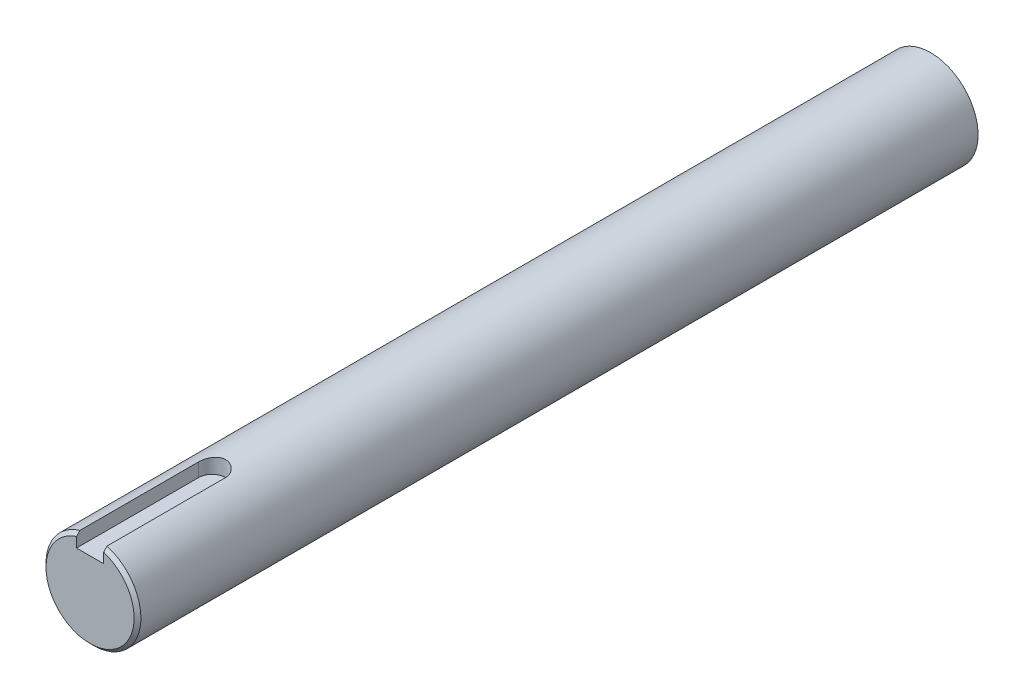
from build123d import *
from build123d.topology import SkipClean

# Parameters (mm, degrees)
EXTRUDE_1_DEPTH      = 98
SKETCH_2_R           = 7
EXTRUDE_4_DEPTH      = 80
CUT_EXTRUDE_20_DEPTH = 80
CHAMFER_1_SIZE       = 0.5
EXTRUDE_START        = 26
SKETCH_7_R           = 7
EXTRUDE_5_DEPTH      = 26


with BuildPart() as part:
    # Sketch 1 → Extrude 1 (new body)
    with BuildSketch(Plane.XY):
        with BuildLine():
            Line((2, 4.7), (-2, 4.7))
            Line((-2, 4.7), (-2, 6.708203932))
            ThreePointArc((-2, 6.708203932), (0, -7), (2, 6.708203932))
            Line((2, 6.708203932), (2, 4.7))
        make_face()
    extrude(amount=EXTRUDE_1_DEPTH)

    # Sketch 2 → Extrude 4 (add)
    with SkipClean():  # the faces are left unmerged after this step: merging them gives an invalid solid
        with BuildSketch(Plane(origin=(0, 0, 0), x_dir=(-1, 0, 0), z_dir=(0, 0, -1))):
            with Locations(Location((0, 0, 0), (0, 0, 73.398450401))):
                Circle(SKETCH_2_R)
        extrude(amount=-EXTRUDE_4_DEPTH)

    # Sketch 6 → Cut-Extrude 20 (cut)
    with SkipClean():  # the faces are left unmerged after this step: merging them gives an invalid solid
        with BuildSketch(Plane(origin=(0, 4.7, 0), x_dir=(1, 0, 0), z_dir=(0, 1, 0))):
            with BuildLine():
                Line((-2, -80), (2, -80))
                ThreePointArc((2, -80), (0, -78), (-2, -80))
            make_face()
        extrude(amount=CUT_EXTRUDE_20_DEPTH, mode=Mode.SUBTRACT)

    # Chamfer 1
    chamfer_1_edges = [part.edges().sort_by_distance(p)[0] for p in [
        (0, -7, 98),
    ]]
    chamfer(chamfer_1_edges, length=CHAMFER_1_SIZE)

    # Sketch 7 → Extrude 5 (add)
    with BuildSketch(Plane(origin=(0, 0, 0), x_dir=(-1, 0, 0), z_dir=(0, 0, -1)).offset(EXTRUDE_START)):
        Circle(SKETCH_7_R)
    extrude(amount=-EXTRUDE_5_DEPTH)


solid = part.part
